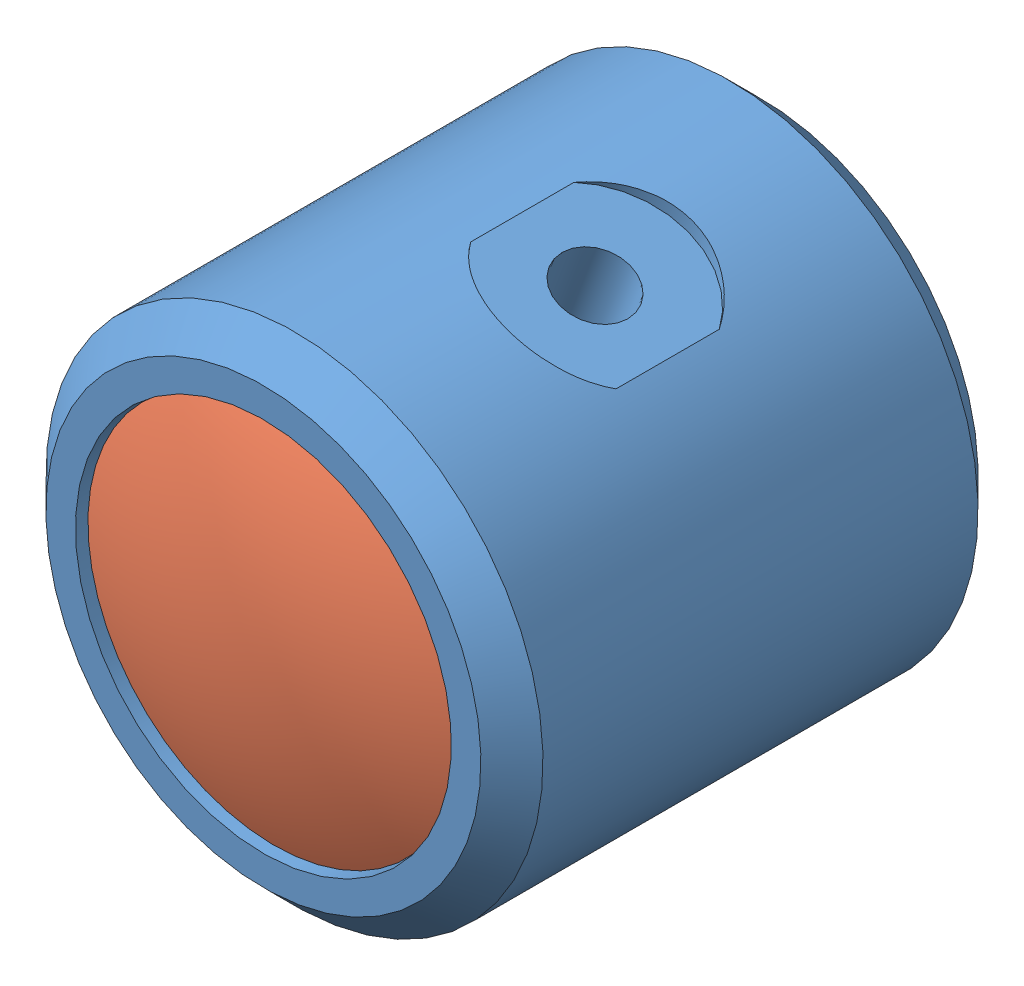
SolidWorks assembly Lens assemblyA.SLDASM, configuration Default (file format 9000). Lengths in mm.
Overall size (20.6 20.6 17.7).
7 component instances, 3 part files, 4 mates.
Components (placement in the parent):
- Lens Mnt TubeA-1: Lens Mnt TubeA.SLDPRT [Default] at (0.088 0.0485 12.6485) x (0 0 1) z (-0.936218 0.351419 0) size (16 16 16)
- Edmund_45793-1: Edmund_45793.sldasm [Default] at (0.088 0.0485 21.4998) x (-0.899918 -0.436059 0) z (0 0 -1) size (12.94 12.23 7)
  - 45793-1-1: 45793-1.SLDPRT [Default] at origin size (12.89 12.2 4.5)
  - 45793-2-1: 45793-2.SLDPRT [Default] at origin size (12.58 12.23 5.21)
- Edmund_45793-2: Edmund_45793.sldasm [Default] at (0.088 0.0485 3.7972) x (-0.996742 0.080651 0) z (0 0 1) size (12.94 12.23 7)
  - 45793-1-1: 45793-1.SLDPRT [Default] at origin size (12.89 12.2 4.5)
  - 45793-2-1: 45793-2.SLDPRT [Default] at origin size (12.58 12.23 5.21)
Mates (geometry in assembly coordinates):
- Concentric6: concentric aligned: cylinder of Lens Mnt TubeA-1 through (0.088 0.0485 -3.1629) axis (0 0 -1) radius 6.05; cylinder of Edmund_45793-1/45793-2-1 through (0.088 0.0485 18.3779) axis (0 0 -1) radius 6
- Concentric7: concentric anti-aligned: cylinder of Lens Mnt TubeA-1 through (0.088 0.0485 -3.1629) axis (0 0 -1) radius 6.05; cylinder of Edmund_45793-2/45793-2-1 through (0.088 0.0485 6.919) axis (0 0 1) radius 6
- Tangent9: tangent: circle of Lens Mnt TubeA-1; face of Edmund_45793-2/45793-2-1
- Tangent10: tangent: circle of Lens Mnt TubeA-1; face of Edmund_45793-1/45793-2-1
